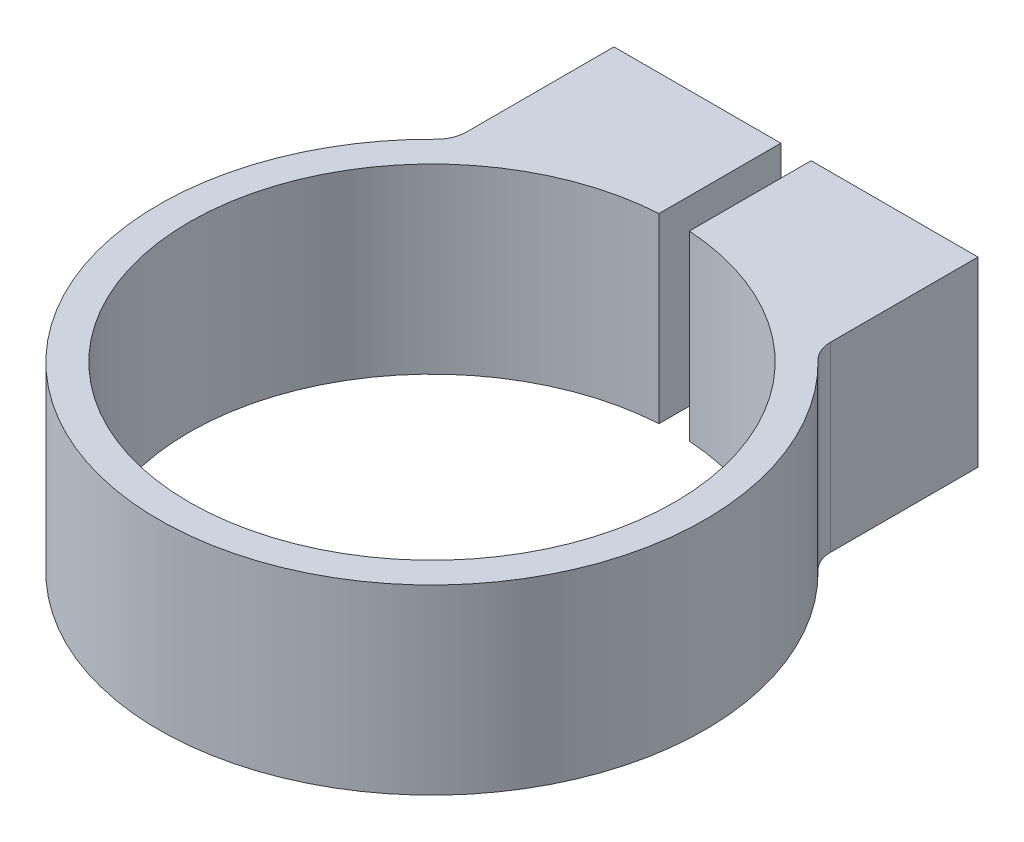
from build123d import *

# Parameters (mm, degrees)
SKETCH1_R          = 50.8
EXTRUDE1_DEPTH     = 38.1
FILLET1_R          = 6.35
SKETCH2_W          = 6.35
SKETCH2_H          = 43.868634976
CUT_EXTRUDE1_DEPTH = 103.587389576


with BuildPart() as part:
    # Sketch1 → Extrude1 (new body)
    with BuildSketch(Plane(origin=(0, 0, 0), x_dir=(1, 0, 0), z_dir=(0, 1, 0))):
        with BuildLine():
            Line((-38.1, 76.2), (38.1, 76.2))
            Line((38.1, 76.2), (38.1, 42.597094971))
            ThreePointArc((38.1, 42.597094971), (0, -57.15), (-38.1, 42.597094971))
            Line((-38.1, 42.597094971), (-38.1, 76.2))
        make_face()
        with Locations(Location((0, 0, 0), (0, 0, 270))):
            Circle(SKETCH1_R, mode=Mode.SUBTRACT)
    extrude(amount=-EXTRUDE1_DEPTH)

    # Fillet1
    fillet1_edges = [part.edges().sort_by_distance(p)[0] for p in [
        (38.1, -19.05, -42.597094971),
        (-38.1, -19.05, -42.597094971),
    ]]
    fillet(fillet1_edges, radius=FILLET1_R)

    # Sketch2 → Cut-Extrude1 (cut, through all)
    with BuildSketch(Plane(origin=(0, 0, 0), x_dir=(-1, 0, 0), z_dir=(0, 1, 0))):
        with Locations((0, -60.752069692)):
            Rectangle(SKETCH2_W, SKETCH2_H)
    extrude(amount=-CUT_EXTRUDE1_DEPTH, mode=Mode.SUBTRACT)


solid = part.part
